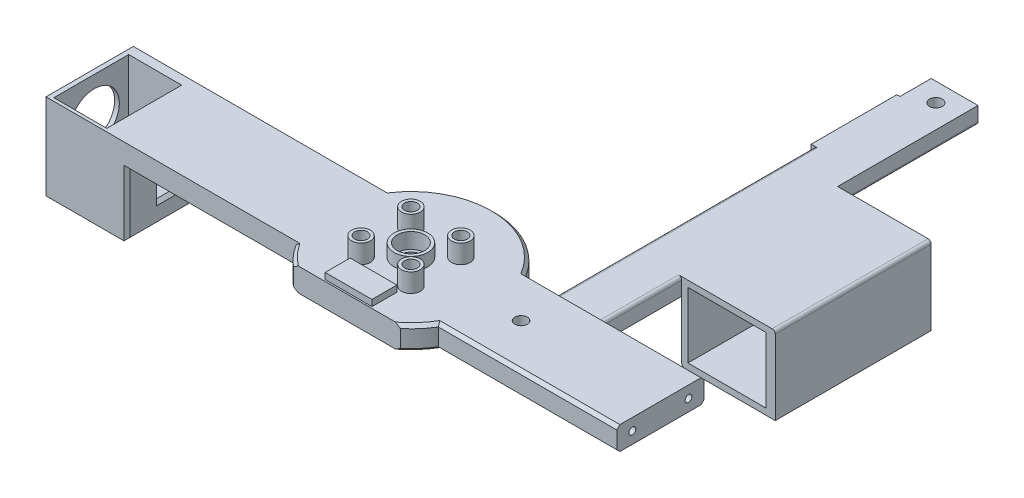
from build123d import *

# Parameters (mm, degrees)
EXTRUDE_1_DEPTH      = 7.5
SKETCH_4_W           = 8
SKETCH_4_H           = 28
EXTRUDE_2_DEPTH      = 20
SKETCH_7_W           = 7
SKETCH_7_H           = 5
CUT_EXTRUDE_1_DEPTH  = 5
SKETCH_8_R           = 4.4
CUT_EXTRUDE_2_DEPTH  = 1
SKETCH_9_R           = 3.4
CUT_EXTRUDE_3_DEPTH  = 8
CHAMFER_1_SIZE       = 1
SKETCH_14_R          = 1.1
CUT_EXTRUDE_6_DEPTH  = 4
SKETCH_15_R          = 2
EXTRUDE_3_DEPTH      = 2.5
SKETCH_17_R          = 3
SKETCH_17_R_2        = 2.05
EXTRUDE_4_DEPTH      = 6
EXTRUDE_START        = 4
SKETCH_18_R          = 5.4
SKETCH_18_R_2        = 4.4
EXTRUDE_5_DEPTH      = 4
SKETCH_19_R          = 2
CUT_EXTRUDE_7_DEPTH  = 6
SKETCH_25_R          = 2.1
CUT_EXTRUDE_9_DEPTH  = 5
SKETCH_26_W          = 28
SKETCH_26_H          = 27.5
EXTRUDE_10_DEPTH     = 18
SKETCH_28_W          = 17
SKETCH_28_H          = 27.5
CUT_EXTRUDE_10_DEPTH = 27
SKETCH_29_R          = 8
CUT_EXTRUDE_11_DEPTH = 3
SKETCH_42_W          = 63.432426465
SKETCH_42_H          = 12
CUT_EXTRUDE_15_DEPTH = 10
SKETCH_43_W          = 3
SKETCH_43_H          = 27.5
EXTRUDE_16_DEPTH     = 18.5
SKETCH_44_W          = 15
SKETCH_44_H          = 5.5
EXTRUDE_17_DEPTH     = 120
SKETCH_45_W          = 50
SKETCH_45_H          = 25
EXTRUDE_18_DEPTH     = 30
SKETCH_46_W          = 25
SKETCH_46_H          = 21
CUT_EXTRUDE_16_DEPTH = 50
SKETCH_48_W          = 27.5
SKETCH_48_H          = 5.5
EXTRUDE_19_DEPTH     = 1
SKETCH_49_R          = 2.05
CUT_EXTRUDE_17_DEPTH = 10
SKETCH_50_R          = 3.5
CUT_EXTRUDE_18_DEPTH = 2.6
FILLET_5_R           = 1
SKETCH_20_W          = 15
SKETCH_20_H          = 8
EXTRUDE_20_DEPTH     = 2


with BuildPart() as part:
    # Sketch 3 → Extrude 1 (new body)
    with BuildSketch(Plane(origin=(0, 0, 0), x_dir=(1, 0, 0), z_dir=(0, 1, 0))):
        with BuildLine():
            Line((22.80171197, 14), (50, 14))
            Line((50, 14), (80, 14))
            Line((80, 14), (80, -14))
            Line((80, -14), (50, -14))
            Line((50, -14), (22.80171197, -14))
            ThreePointArc((22.80171197, -14), (0, -26.75664532), (-22.80171197, -14))
            Line((-22.80171197, -14), (-50, -14))
            Line((-50, -14), (-85, -14))
            Line((-85, -14), (-85, 14))
            Line((-85, 14), (-50, 14))
            Line((-50, 14), (-22.80171197, 14))
            ThreePointArc((-22.80171197, 14), (0, 26.75664532), (22.80171197, 14))
        make_face()
    extrude(amount=EXTRUDE_1_DEPTH)

    # Sketch 4 → Extrude 2 (add)
    with BuildSketch(Plane.XZ):
        with Locations((-81, 0)):
            Rectangle(SKETCH_4_W, SKETCH_4_H)
    extrude(amount=EXTRUDE_2_DEPTH)

    # Sketch 7 → Cut-Extrude 1 (cut)
    with BuildSketch(Plane(origin=(-77, 0, 0), x_dir=(0, 0, -1), z_dir=(1, 0, 0))):
        with Locations((0, -11)):
            Rectangle(SKETCH_7_W, SKETCH_7_H)
    extrude(amount=-CUT_EXTRUDE_1_DEPTH, mode=Mode.SUBTRACT)

    # Sketch 8 → Cut-Extrude 2 (cut)
    with BuildSketch(Plane(origin=(0, 7.5, 0), x_dir=(1, 0, 0), z_dir=(0, 1, 0))):
        with Locations(Location((0, 0, 0), (0, 0, 270))):
            Circle(SKETCH_8_R)
    extrude(amount=-CUT_EXTRUDE_2_DEPTH, mode=Mode.SUBTRACT)

    # Sketch 9 → Cut-Extrude 3 (cut)
    with BuildSketch(Plane(origin=(0, 6.5, 0), x_dir=(1, 0, 0), z_dir=(0, 1, 0))):
        with Locations(Location((0, 0, 0), (0, 0, 270))):
            Circle(SKETCH_9_R)
    extrude(amount=-CUT_EXTRUDE_3_DEPTH, mode=Mode.SUBTRACT)

    # Chamfer 1
    chamfer_1_edges = [part.edges().sort_by_distance(p)[0] for p in [
        (-49.900855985, 0, -14),
        (0, 0, -26.75664532),
        (51.400855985, 0, -14),
        (51.400855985, 0, 14),
        (0, 0, 26.75664532),
        (-49.900855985, 0, 14),
        (0, 7.5, 26.75664532),
        (51.400855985, 7.5, 14),
        (51.400855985, 7.5, -14),
        (0, 7.5, -26.75664532),
        (-77, -10, 14),
        (-77, -20, 0),
        (-77, -10, -14),
        (-77, -13.5, 0),
        (-77, -11, -3.5),
        (-77, -11, 3.5),
        (-77, -8.5, 0),
    ]]
    chamfer(chamfer_1_edges, length=CHAMFER_1_SIZE)

    # Sketch 14 → Cut-Extrude 6 (cut)
    with BuildSketch(Plane(origin=(80, 0, 0), x_dir=(0, 0, -1), z_dir=(1, 0, 0))):
        with Locations((-9, 3.75)):
            Circle(SKETCH_14_R)
        with Locations(Location((9, 3.75, 0), (0, 0, 180))):
            Circle(SKETCH_14_R)
    extrude(amount=-CUT_EXTRUDE_6_DEPTH, mode=Mode.SUBTRACT)

    # Sketch 15 → Extrude 3 (add)
    with BuildSketch(Plane.XZ):
        with Locations(Location((-17, 0, 0), (0, 0, 90))):
            Circle(SKETCH_15_R)
    extrude(amount=EXTRUDE_3_DEPTH)

    # Sketch 17 → Extrude 4 (add)
    # profile 1 of 4: a face of its own
    with BuildSketch(Plane(origin=(0, 7.5, 0), x_dir=(1, 0, 0), z_dir=(0, 1, 0))):
        with Locations(Location((-8, 8, 0), (0, 0, 270))):
            Circle(SKETCH_17_R)
        with Locations(Location((-8, 8, 0), (0, 0, 270))):
            Circle(SKETCH_17_R_2, mode=Mode.SUBTRACT)
    # profile 2 of 4: a face of its own
    with BuildSketch(Plane(origin=(0, 7.5, 0), x_dir=(1, 0, 0), z_dir=(0, 1, 0))):
        with Locations(Location((8, 8, 0), (0, 0, 270))):
            Circle(SKETCH_17_R)
        with Locations(Location((8, 8, 0), (0, 0, 270))):
            Circle(SKETCH_17_R_2, mode=Mode.SUBTRACT)
    # profile 3 of 4: a face of its own
    with BuildSketch(Plane(origin=(0, 7.5, 0), x_dir=(1, 0, 0), z_dir=(0, 1, 0))):
        with Locations(Location((-8, -8, 0), (0, 0, 270))):
            Circle(SKETCH_17_R)
        with Locations(Location((-8, -8, 0), (0, 0, 270))):
            Circle(SKETCH_17_R_2, mode=Mode.SUBTRACT)
    # profile 4 of 4: a face of its own
    with BuildSketch(Plane(origin=(0, 7.5, 0), x_dir=(1, 0, 0), z_dir=(0, 1, 0))):
        with Locations(Location((8, -8, 0), (0, 0, 270))):
            Circle(SKETCH_17_R)
        with Locations(Location((8, -8, 0), (0, 0, 270))):
            Circle(SKETCH_17_R_2, mode=Mode.SUBTRACT)
    extrude(amount=EXTRUDE_4_DEPTH)

    # Sketch 18 → Extrude 5 (add)
    with BuildSketch(Plane(origin=(0, 7.5, 0), x_dir=(1, 0, 0), z_dir=(0, 1, 0)).offset(EXTRUDE_START)):
        with Locations(Location((0, 0, 0), (0, 0, 270))):
            Circle(SKETCH_18_R)
        with Locations(Location((0, 0, 0), (0, 0, 270))):
            Circle(SKETCH_18_R_2, mode=Mode.SUBTRACT)
    extrude(amount=-EXTRUDE_5_DEPTH)

    # Sketch 19 → Cut-Extrude 7 (cut)
    with BuildSketch(Plane(origin=(0, 7.5, 0), x_dir=(1, 0, 0), z_dir=(0, 1, 0))):
        with Locations(Location((35.302478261, 0, 0), (0, 0, 270))):
            Circle(SKETCH_19_R)
    extrude(amount=-CUT_EXTRUDE_7_DEPTH, mode=Mode.SUBTRACT)

    # Sketch 25 → Cut-Extrude 9 (cut)
    with BuildSketch(Plane.ZY.offset(85)):
        with Locations((0, -4.5)):
            Circle(SKETCH_25_R)
    extrude(amount=-CUT_EXTRUDE_9_DEPTH, mode=Mode.SUBTRACT)

    # Sketch 26 → Extrude 10 (add)
    with BuildSketch(Plane.ZY.offset(85)):
        with Locations((0, -6.25)):
            Rectangle(SKETCH_26_W, SKETCH_26_H)
    extrude(amount=EXTRUDE_10_DEPTH)

    # Sketch 28 → Cut-Extrude 10 (cut)
    with BuildSketch(Plane(origin=(0, 0, -14), x_dir=(-1, 0, 0), z_dir=(0, 0, -1))):
        with Locations((93, -6.25)):
            Rectangle(SKETCH_28_W, SKETCH_28_H)
    extrude(amount=-CUT_EXTRUDE_10_DEPTH, mode=Mode.SUBTRACT)

    # Sketch 29 → Cut-Extrude 11 (cut)
    with BuildSketch(Plane.ZY.offset(103)):
        with Locations((0, -4.5)):
            Circle(SKETCH_29_R)
    extrude(amount=-CUT_EXTRUDE_11_DEPTH, mode=Mode.SUBTRACT)

    # Sketch 42 → Cut-Extrude 15 (cut)
    with BuildSketch(Plane(origin=(0, 7.5, 0), x_dir=(1, 0, 0), z_dir=(0, 1, 0))):
        with Locations((1.880046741, -26.518154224)):
            Rectangle(SKETCH_42_W, SKETCH_42_H)
    extrude(amount=-CUT_EXTRUDE_15_DEPTH, mode=Mode.SUBTRACT)

    # Sketch 43 → Extrude 16 (add)
    with BuildSketch(Plane.ZY.offset(84.5)):
        with Locations((-12.5, -6.25)):
            Rectangle(SKETCH_43_W, SKETCH_43_H)
    extrude(amount=EXTRUDE_16_DEPTH)

    # Sketch 44 → Extrude 17 (add)
    with BuildSketch(Plane(origin=(0, 0, -14), x_dir=(-1, 0, 0), z_dir=(0, 0, -1))):
        with Locations((-40.30171197, 3.75)):
            Rectangle(SKETCH_44_W, SKETCH_44_H)
    extrude(amount=EXTRUDE_17_DEPTH)

    # Sketch 45 → Extrude 18 (add)
    with BuildSketch(Plane(origin=(47.80171197, 0, 0), x_dir=(0, 0, -1), z_dir=(1, 0, 0))):
        with Locations((64, -6)):
            Rectangle(SKETCH_45_W, SKETCH_45_H)
    extrude(amount=EXTRUDE_18_DEPTH)

    # Sketch 46 → Cut-Extrude 16 (cut)
    with BuildSketch(Plane.XY.offset(-39)):
        with Locations((62.30171197, -6)):
            Rectangle(SKETCH_46_W, SKETCH_46_H)
    extrude(amount=-CUT_EXTRUDE_16_DEPTH, mode=Mode.SUBTRACT)

    # Sketch 48 → Extrude 19 (add)
    with BuildSketch(Plane.ZY.offset(-32.80171197)):
        with Locations((-110.25, 3.75)):
            Rectangle(SKETCH_48_W, SKETCH_48_H)
    extrude(amount=EXTRUDE_19_DEPTH)

    # Sketch 49 → Cut-Extrude 17 (cut)
    with BuildSketch(Plane(origin=(0, 6.5, 0), x_dir=(1, 0, 0), z_dir=(0, 1, 0))):
        with Locations(Location((40.30171197, 128, 0), (0, 0, 270))):
            Circle(SKETCH_49_R)
    extrude(amount=-CUT_EXTRUDE_17_DEPTH, mode=Mode.SUBTRACT)

    # Sketch 50 → Cut-Extrude 18 (cut)
    with BuildSketch(Plane.XZ.offset(-1)):
        with Locations(Location((40.30171197, -128, 0), (0, 0, 270))):
            Circle(SKETCH_50_R)
    extrude(amount=-CUT_EXTRUDE_18_DEPTH, mode=Mode.SUBTRACT)

    # Fillet 5
    fillet_5_edges = [part.edges().sort_by_distance(p)[0] for p in [
        (47.80171197, 6.5, -26.5),
        (47.80171197, 1, -111.5),
        (32.80171197, 6.5, -55.25),
        (31.80171197, 1, -110.25),
        (47.80171197, -18.5, -64),
        (77.80171197, 6.5, -64),
    ]]
    fillet(fillet_5_edges, radius=FILLET_5_R)

    # Sketch 20 → Extrude 20 (add)
    with BuildSketch(Plane(origin=(0, 7.5, 0), x_dir=(1, 0, 0), z_dir=(0, 1, 0))):
        with Locations((0, -16)):
            Rectangle(SKETCH_20_W, SKETCH_20_H)
    extrude(amount=EXTRUDE_20_DEPTH)


solid = part.part
